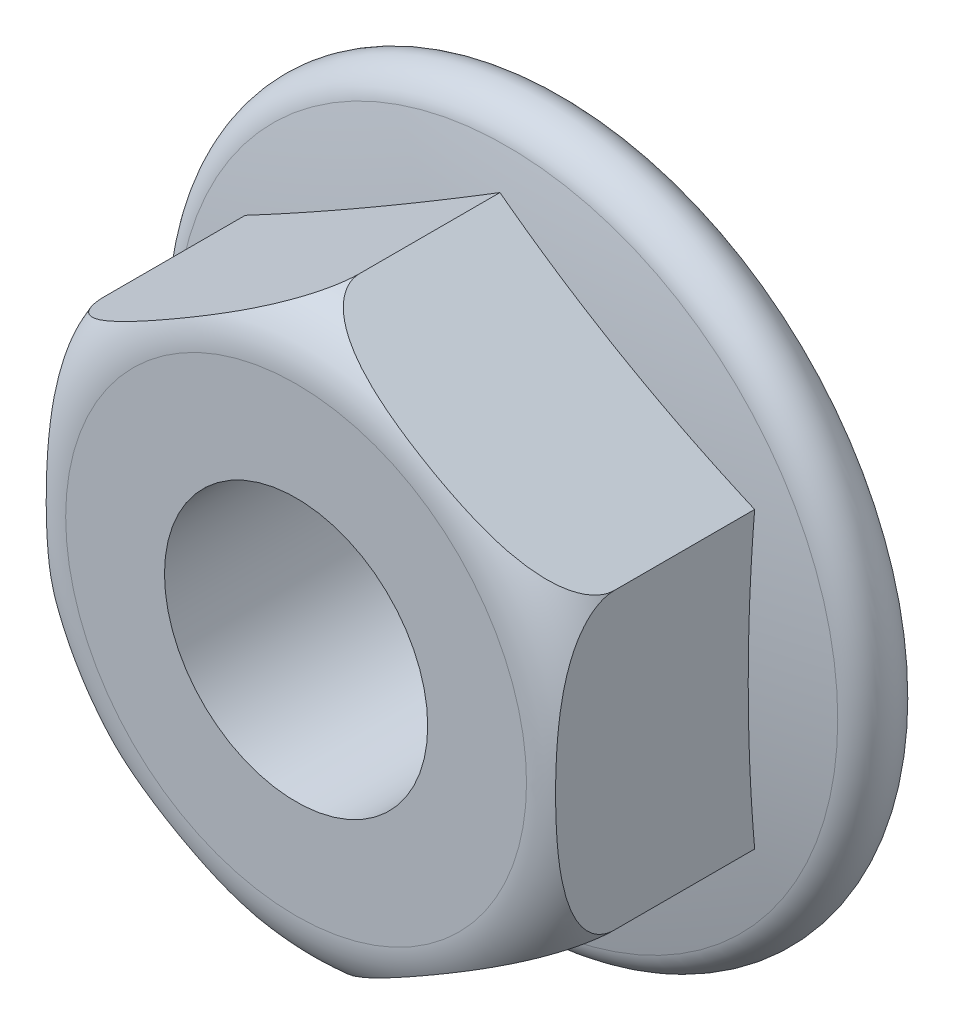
ISO-10303-21;
HEADER;
FILE_DESCRIPTION(('STEP AP214'),'2;1');
FILE_NAME('part.step','',(''),(''),'','','');
FILE_SCHEMA(('AUTOMOTIVE_DESIGN { 1 0 10303 214 1 1 1 1 }'));
ENDSEC;
DATA;
#1=APPLICATION_CONTEXT('core data for automotive mechanical design processes');
#2=APPLICATION_PROTOCOL_DEFINITION('international standard','automotive_design',2000,#1);
#3=PRODUCT_CONTEXT('',#1,'mechanical');
#4=PRODUCT('Part','Part','',(#3));
#5=PRODUCT_RELATED_PRODUCT_CATEGORY('part','',(#4));
#6=PRODUCT_DEFINITION_FORMATION('','',#4);
#7=PRODUCT_DEFINITION_CONTEXT('part definition',#1,'design');
#8=PRODUCT_DEFINITION('design','',#6,#7);
#9=PRODUCT_DEFINITION_SHAPE('','',#8);
#10=(LENGTH_UNIT() NAMED_UNIT(*) SI_UNIT(.MILLI.,.METRE.));
#11=(NAMED_UNIT(*) PLANE_ANGLE_UNIT() SI_UNIT($,.RADIAN.));
#12=(NAMED_UNIT(*) SI_UNIT($,.STERADIAN.) SOLID_ANGLE_UNIT());
#13=UNCERTAINTY_MEASURE_WITH_UNIT(LENGTH_MEASURE(1.E-05),#10,'distance_accuracy_value','');
#14=(GEOMETRIC_REPRESENTATION_CONTEXT(3) GLOBAL_UNCERTAINTY_ASSIGNED_CONTEXT((#13)) GLOBAL_UNIT_ASSIGNED_CONTEXT((#10,
#11,#12)) REPRESENTATION_CONTEXT('',''));
#15=CARTESIAN_POINT('',(0.,0.,0.));
#16=DIRECTION('',(0.,0.,1.));
#17=DIRECTION('',(1.,0.,0.));
#18=AXIS2_PLACEMENT_3D('',#15,#16,#17);
#19=CARTESIAN_POINT('',(-3.99999999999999,2.3094010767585,4.3));
#20=DIRECTION('',(-0.5,0.866025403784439,0.));
#21=DIRECTION('',(-0.866025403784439,-0.5,0.));
#22=AXIS2_PLACEMENT_3D('',#19,#20,#21);
#23=PLANE('',#22);
#24=DIRECTION('',(0.,0.,-1.));
#25=VECTOR('',#24,1.);
#26=CARTESIAN_POINT('',(-3.99999999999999,2.3094010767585,4.3));
#27=LINE('',#26,#25);
#28=CARTESIAN_POINT('',(-3.99999999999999,2.3094010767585,3.3));
#29=VERTEX_POINT('',#28);
#30=CARTESIAN_POINT('',(-3.99999999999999,2.3094010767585,1.09838133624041));
#31=VERTEX_POINT('',#30);
#32=EDGE_CURVE('E46',#29,#31,#27,.T.);
#33=ORIENTED_EDGE('',*,*,#32,.F.);
#34=CARTESIAN_POINT('',(-3.99999996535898,2.3094010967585,3.2998));
#35=CARTESIAN_POINT('',(-4.00006693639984,2.30936243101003,3.32953837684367));
#36=CARTESIAN_POINT('',(-3.99772655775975,2.31071364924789,3.35921042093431));
#37=CARTESIAN_POINT('',(-3.98871911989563,2.31591409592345,3.41742994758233));
#38=CARTESIAN_POINT('',(-3.98208701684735,2.31974314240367,3.44598455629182));
#39=CARTESIAN_POINT('',(-3.96499187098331,2.32961302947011,3.50141061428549));
#40=CARTESIAN_POINT('',(-3.95453843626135,2.33564832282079,3.52828608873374));
#41=CARTESIAN_POINT('',(-3.93043339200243,2.3495653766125,3.58008941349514));
#42=CARTESIAN_POINT('',(-3.91677501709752,2.35745104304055,3.60501299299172));
#43=CARTESIAN_POINT('',(-3.87798147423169,2.37984850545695,3.66692169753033));
#44=CARTESIAN_POINT('',(-3.85085718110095,2.39550872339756,3.70224456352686));
#45=CARTESIAN_POINT('',(-3.7921773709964,2.42938752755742,3.76755530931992));
#46=CARTESIAN_POINT('',(-3.76061113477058,2.4476123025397,3.79752987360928));
#47=CARTESIAN_POINT('',(-3.67234050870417,2.49857537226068,3.87126336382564));
#48=CARTESIAN_POINT('',(-3.61299025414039,2.53284125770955,3.91076135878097));
#49=CARTESIAN_POINT('',(-3.49007027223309,2.60380914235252,3.97948013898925));
#50=CARTESIAN_POINT('',(-3.42649081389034,2.64051675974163,4.00867617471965));
#51=CARTESIAN_POINT('',(-3.27192645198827,2.72975453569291,4.06911046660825));
#52=CARTESIAN_POINT('',(-3.17990156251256,2.78288513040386,4.09672533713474));
#53=CARTESIAN_POINT('',(-2.99393197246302,2.89025472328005,4.14172138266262));
#54=CARTESIAN_POINT('',(-2.89998324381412,2.94449604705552,4.15907818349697));
#55=CARTESIAN_POINT('',(-2.71080977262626,3.05371540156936,4.18673692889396));
#56=CARTESIAN_POINT('',(-2.61558082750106,3.10869585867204,4.19699871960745));
#57=CARTESIAN_POINT('',(-2.42493080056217,3.21876770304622,4.2123936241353));
#58=CARTESIAN_POINT('',(-2.32950999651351,3.27385892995,4.21753172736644));
#59=CARTESIAN_POINT('',(-2.1445379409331,3.38065259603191,4.22363284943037));
#60=CARTESIAN_POINT('',(-2.0549922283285,3.43235183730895,4.22483653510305));
#61=CARTESIAN_POINT('',(-1.87588150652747,3.53576146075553,4.22398619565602));
#62=CARTESIAN_POINT('',(-1.78631650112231,3.58747184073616,4.2219310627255));
#63=CARTESIAN_POINT('',(-1.60765259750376,3.6906234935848,4.21416278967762));
#64=CARTESIAN_POINT('',(-1.51855326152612,3.74206501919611,4.20846422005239));
#65=CARTESIAN_POINT('',(-1.34070462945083,3.84474597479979,4.19234278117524));
#66=CARTESIAN_POINT('',(-1.25195519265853,3.89598548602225,4.18192206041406));
#67=CARTESIAN_POINT('',(-1.07317682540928,3.99920322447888,4.15424222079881));
#68=CARTESIAN_POINT('',(-0.98316343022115,4.05117248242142,4.13683594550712));
#69=CARTESIAN_POINT('',(-0.849463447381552,4.12836420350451,4.10338551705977));
#70=CARTESIAN_POINT('',(-0.805093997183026,4.15398091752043,4.09100349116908));
#71=CARTESIAN_POINT('',(-0.717059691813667,4.20480754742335,4.06328291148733));
#72=CARTESIAN_POINT('',(-0.673394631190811,4.23001758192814,4.047945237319));
#73=CARTESIAN_POINT('',(-0.568770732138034,4.29042221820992,4.00646579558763));
#74=CARTESIAN_POINT('',(-0.508337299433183,4.32531347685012,3.97850133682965));
#75=CARTESIAN_POINT('',(-0.391336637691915,4.39286384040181,3.91326671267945));
#76=CARTESIAN_POINT('',(-0.334759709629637,4.42552854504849,3.87602107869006));
#77=CARTESIAN_POINT('',(-0.250976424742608,4.47390084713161,3.80773747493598));
#78=CARTESIAN_POINT('',(-0.221387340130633,4.4909841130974,3.78062466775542));
#79=CARTESIAN_POINT('',(-0.165742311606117,4.5231107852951,3.72186611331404));
#80=CARTESIAN_POINT('',(-0.139683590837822,4.53815579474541,3.69022396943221));
#81=CARTESIAN_POINT('',(-0.0975119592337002,4.56250359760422,3.62919400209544));
#82=CARTESIAN_POINT('',(-0.0804559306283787,4.5723509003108,3.60068306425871));
#83=CARTESIAN_POINT('',(-0.0505893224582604,4.5895943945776,3.54089256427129));
#84=CARTESIAN_POINT('',(-0.0377656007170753,4.59699817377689,3.50962196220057));
#85=CARTESIAN_POINT('',(-0.0186652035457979,4.60802579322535,3.44898520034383));
#86=CARTESIAN_POINT('',(-0.0117616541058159,4.61201155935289,3.41988566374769));
#87=CARTESIAN_POINT('',(-0.00237377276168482,4.61743165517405,3.36048910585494));
#88=CARTESIAN_POINT('',(6.98382047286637E-05,4.6188424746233,3.3301836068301));
#89=CARTESIAN_POINT('',(-3.46410181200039E-08,4.618802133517,3.2998));
#90=B_SPLINE_CURVE_WITH_KNOTS('',3,(#34,#35,#36,#37,#38,#39,#40,#41,#42,#43,#44,#45,#46,#47,#48,
#49,#50,#51,#52,#53,#54,#55,#56,#57,#58,#59,#60,#61,#62,#63,#64,#65,#66,#67,#68,#69,#70,#71,#72,
#73,#74,#75,#76,#77,#78,#79,#80,#81,#82,#83,#84,#85,#86,#87,#88,#89),.UNSPECIFIED.,.F.,.F.,(4,2,
2,2,2,2,2,2,2,2,2,2,2,2,2,2,2,2,2,2,2,2,2,2,2,2,2,4),(0.,0.0889843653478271,0.177252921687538,
0.265301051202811,0.353536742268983,0.494349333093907,0.635507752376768,0.871460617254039,
1.10797653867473,1.43649527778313,1.76579150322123,2.09693643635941,2.42775858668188,
2.73792356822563,3.04819401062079,3.35723134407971,3.66612821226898,3.98190583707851,
4.13995968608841,4.29796656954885,4.52303266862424,4.74751008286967,4.87804562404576,
5.00847788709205,5.11205914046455,5.21531565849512,5.30538832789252,5.39627935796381),.UNSPECIFIED.);
#91=CARTESIAN_POINT('',(0.,4.618802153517,3.3));
#92=VERTEX_POINT('',#91);
#93=EDGE_CURVE('E93',#29,#92,#90,.T.);
#94=ORIENTED_EDGE('',*,*,#93,.T.);
#95=DIRECTION('',(0.,0.,-1.));
#96=VECTOR('',#95,1.);
#97=CARTESIAN_POINT('',(0.,4.618802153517,4.3));
#98=LINE('',#97,#96);
#99=CARTESIAN_POINT('',(0.,4.618802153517,1.09838133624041));
#100=VERTEX_POINT('',#99);
#101=EDGE_CURVE('E100',#92,#100,#98,.T.);
#102=ORIENTED_EDGE('',*,*,#101,.T.);
#103=CARTESIAN_POINT('',(-2.,3.46410161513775,-25.26));
#104=DIRECTION('',(-0.5,0.866025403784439,0.));
#105=DIRECTION('',(-0.866025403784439,-0.5,0.));
#106=AXIS2_PLACEMENT_3D('',#103,#104,#105);
#107=CIRCLE('',#106,26.4593575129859);
#108=EDGE_CURVE('E108',#31,#100,#107,.T.);
#109=ORIENTED_EDGE('',*,*,#108,.F.);
#110=EDGE_LOOP('',(#33,#94,#102,#109));
#111=FACE_BOUND('',#110,.T.);
#112=ADVANCED_FACE('F38',(#111),#23,.T.);
#113=CARTESIAN_POINT('',(-4.00000000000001,-2.30940107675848,4.3));
#114=DIRECTION('',(-1.,0.,0.));
#115=DIRECTION('',(0.,-1.,0.));
#116=AXIS2_PLACEMENT_3D('',#113,#114,#115);
#117=PLANE('',#116);
#118=DIRECTION('',(0.,0.,-1.));
#119=VECTOR('',#118,1.);
#120=CARTESIAN_POINT('',(-4.00000000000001,-2.30940107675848,4.3));
#121=LINE('',#120,#119);
#122=CARTESIAN_POINT('',(-4.00000000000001,-2.30940107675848,3.3));
#123=VERTEX_POINT('',#122);
#124=CARTESIAN_POINT('',(-4.,-2.30940107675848,1.09838133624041));
#125=VERTEX_POINT('',#124);
#126=EDGE_CURVE('E117',#123,#125,#121,.T.);
#127=ORIENTED_EDGE('',*,*,#126,.F.);
#128=CARTESIAN_POINT('',(-4.,0.,4.22449348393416));
#129=CARTESIAN_POINT('',(-4.,0.0938029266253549,4.22449354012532));
#130=CARTESIAN_POINT('',(-4.,0.18760595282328,4.22315155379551));
#131=CARTESIAN_POINT('',(-4.,0.375150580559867,4.21755982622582));
#132=CARTESIAN_POINT('',(-4.,0.468892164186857,4.2133094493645));
#133=CARTESIAN_POINT('',(-4.,0.65602175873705,4.20123019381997));
#134=CARTESIAN_POINT('',(-4.,0.749410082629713,4.19340640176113));
#135=CARTESIAN_POINT('',(-4.,0.935650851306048,4.1730248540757));
#136=CARTESIAN_POINT('',(-4.,1.02850353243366,4.16046937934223));
#137=CARTESIAN_POINT('',(-4.,1.21307543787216,4.12891499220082));
#138=CARTESIAN_POINT('',(-4.,1.30479545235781,4.10992086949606));
#139=CARTESIAN_POINT('',(-4.,1.48610336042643,4.06303126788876));
#140=CARTESIAN_POINT('',(-4.,1.57569077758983,4.03513381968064));
#141=CARTESIAN_POINT('',(-4.,1.72830231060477,3.97553924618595));
#142=CARTESIAN_POINT('',(-4.,1.79236193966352,3.94654156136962));
#143=CARTESIAN_POINT('',(-4.,1.91572209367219,3.87969101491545));
#144=CARTESIAN_POINT('',(-4.,1.97503500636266,3.84186228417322));
#145=CARTESIAN_POINT('',(-4.,2.06220485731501,3.77325670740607));
#146=CARTESIAN_POINT('',(-3.99999999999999,2.09288594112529,3.74608878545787));
#147=CARTESIAN_POINT('',(-3.99999999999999,2.15008745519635,3.68764144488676));
#148=CARTESIAN_POINT('',(-3.99999999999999,2.17661267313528,3.65636683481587));
#149=CARTESIAN_POINT('',(-3.99999999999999,2.21934787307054,3.59601861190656));
#150=CARTESIAN_POINT('',(-3.99999999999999,2.23656032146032,3.5676616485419));
#151=CARTESIAN_POINT('',(-3.99999999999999,2.26612373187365,3.50849566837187));
#152=CARTESIAN_POINT('',(-3.99999999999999,2.27847829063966,3.47768848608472));
#153=CARTESIAN_POINT('',(-3.99999999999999,2.29740225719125,3.41400667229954));
#154=CARTESIAN_POINT('',(-3.99999999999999,2.30391865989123,3.38111594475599));
#155=CARTESIAN_POINT('',(-3.99999999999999,2.31028900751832,3.31469779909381));
#156=CARTESIAN_POINT('',(-3.99999999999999,2.31014754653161,3.28117083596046));
#157=CARTESIAN_POINT('',(-3.99999999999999,2.30372938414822,3.21952425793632));
#158=CARTESIAN_POINT('',(-3.99999999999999,2.29832118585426,3.19130916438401));
#159=CARTESIAN_POINT('',(-3.99999999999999,2.28304658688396,3.13612423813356));
#160=CARTESIAN_POINT('',(-3.99999999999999,2.27317884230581,3.10915478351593));
#161=CARTESIAN_POINT('',(-3.99999999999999,2.24600058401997,3.04897084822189));
#162=CARTESIAN_POINT('',(-3.99999999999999,2.22733669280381,3.01636972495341));
#163=CARTESIAN_POINT('',(-3.99999999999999,2.18498581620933,2.9546162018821));
#164=CARTESIAN_POINT('',(-3.99999999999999,2.16128864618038,2.92547098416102));
#165=CARTESIAN_POINT('',(-3.99999999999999,2.09764904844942,2.85718234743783));
#166=CARTESIAN_POINT('',(-4.,2.05544525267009,2.82016177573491));
#167=CARTESIAN_POINT('',(-4.,1.96596513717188,2.75297844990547));
#168=CARTESIAN_POINT('',(-4.,1.91867988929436,2.7228280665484));
#169=CARTESIAN_POINT('',(-4.,1.82542710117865,2.67078581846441));
#170=CARTESIAN_POINT('',(-4.,1.77973451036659,2.64839086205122));
#171=CARTESIAN_POINT('',(-4.,1.68658396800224,2.60757873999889));
#172=CARTESIAN_POINT('',(-4.,1.63912445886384,2.58916518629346));
#173=CARTESIAN_POINT('',(-4.,1.54291831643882,2.55563775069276));
#174=CARTESIAN_POINT('',(-4.,1.49416837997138,2.5405334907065));
#175=CARTESIAN_POINT('',(-4.,1.39591987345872,2.51315258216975));
#176=CARTESIAN_POINT('',(-4.,1.34642169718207,2.50087449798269));
#177=CARTESIAN_POINT('',(-4.,1.21347450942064,2.47121229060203));
#178=CARTESIAN_POINT('',(-4.,1.12955678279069,2.45593927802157));
#179=CARTESIAN_POINT('',(-4.,0.960958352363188,2.43029743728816));
#180=CARTESIAN_POINT('',(-4.,0.876277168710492,2.41993194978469));
#181=CARTESIAN_POINT('',(-4.,0.706315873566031,2.40290165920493));
#182=CARTESIAN_POINT('',(-4.,0.621034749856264,2.3962472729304));
#183=CARTESIAN_POINT('',(-4.,0.45032547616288,2.38585497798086));
#184=CARTESIAN_POINT('',(-4.,0.3648973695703,2.38211632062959));
#185=CARTESIAN_POINT('',(-4.,0.193190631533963,2.37703368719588));
#186=CARTESIAN_POINT('',(-4.,0.106911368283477,2.37571192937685));
#187=CARTESIAN_POINT('',(-4.,-0.0656610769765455,2.37534495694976));
#188=CARTESIAN_POINT('',(-4.,-0.151954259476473,2.37629999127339));
#189=CARTESIAN_POINT('',(-4.,-0.324305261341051,2.38061694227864));
#190=CARTESIAN_POINT('',(-4.,-0.410363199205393,2.38397389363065));
#191=CARTESIAN_POINT('',(-4.,-0.582311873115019,2.39354456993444));
#192=CARTESIAN_POINT('',(-4.,-0.66820263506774,2.399757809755));
#193=CARTESIAN_POINT('',(-4.,-0.846082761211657,2.41643295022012));
#194=CARTESIAN_POINT('',(-4.,-0.938046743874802,2.42717837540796));
#195=CARTESIAN_POINT('',(-4.,-1.1213152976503,2.45437717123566));
#196=CARTESIAN_POINT('',(-4.,-1.21261864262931,2.47083926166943));
#197=CARTESIAN_POINT('',(-4.,-1.39223847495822,2.51128945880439));
#198=CARTESIAN_POINT('',(-4.,-1.48057894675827,2.5351677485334));
#199=CARTESIAN_POINT('',(-4.,-1.65369370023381,2.59329463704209));
#200=CARTESIAN_POINT('',(-4.,-1.73847920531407,2.62750727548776));
#201=CARTESIAN_POINT('',(-4.,-1.86769365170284,2.69328032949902));
#202=CARTESIAN_POINT('',(-4.,-1.91445548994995,2.72021117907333));
#203=CARTESIAN_POINT('',(-4.,-2.00409079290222,2.78010625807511));
#204=CARTESIAN_POINT('',(-4.,-2.04696380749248,2.81307118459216));
#205=CARTESIAN_POINT('',(-4.,-2.11593661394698,2.87629384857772));
#206=CARTESIAN_POINT('',(-4.00000000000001,-2.14347586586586,2.90496727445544));
#207=CARTESIAN_POINT('',(-4.00000000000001,-2.19377764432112,2.96625261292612));
#208=CARTESIAN_POINT('',(-4.00000000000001,-2.21654845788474,2.99885753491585));
#209=CARTESIAN_POINT('',(-4.00000000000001,-2.2513279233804,3.06018740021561));
#210=CARTESIAN_POINT('',(-4.00000000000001,-2.26460200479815,3.08818980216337));
#211=CARTESIAN_POINT('',(-4.00000000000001,-2.28635138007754,3.14601091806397));
#212=CARTESIAN_POINT('',(-4.00000000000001,-2.29483047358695,3.17582817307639));
#213=CARTESIAN_POINT('',(-4.00000000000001,-2.30633410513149,3.2366963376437));
#214=CARTESIAN_POINT('',(-4.00000000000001,-2.30932668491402,3.26775340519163));
#215=CARTESIAN_POINT('',(-4.00000000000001,-2.30947267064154,3.32988100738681));
#216=CARTESIAN_POINT('',(-4.00000000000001,-2.3066266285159,3.36095154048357));
#217=CARTESIAN_POINT('',(-4.00000000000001,-2.29587021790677,3.41934843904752));
#218=CARTESIAN_POINT('',(-4.00000000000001,-2.28842788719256,3.44676357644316));
#219=CARTESIAN_POINT('',(-4.00000000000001,-2.26944739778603,3.50012278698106));
#220=CARTESIAN_POINT('',(-4.00000000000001,-2.25790777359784,3.52606632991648));
#221=CARTESIAN_POINT('',(-4.00000000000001,-2.2259792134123,3.58629797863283));
#222=CARTESIAN_POINT('',(-4.00000000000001,-2.20389996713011,3.6196887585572));
#223=CARTESIAN_POINT('',(-4.00000000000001,-2.1546858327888,3.68250188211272));
#224=CARTESIAN_POINT('',(-4.,-2.12753978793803,3.71191521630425));
#225=CARTESIAN_POINT('',(-4.,-2.05390946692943,3.78185123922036));
#226=CARTESIAN_POINT('',(-4.,-2.00493121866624,3.81972826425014));
#227=CARTESIAN_POINT('',(-4.,-1.90191391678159,3.88772449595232));
#228=CARTESIAN_POINT('',(-4.,-1.84786362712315,3.91782589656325));
#229=CARTESIAN_POINT('',(-4.,-1.73942977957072,3.97038611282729));
#230=CARTESIAN_POINT('',(-4.,-1.68518779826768,3.99314331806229));
#231=CARTESIAN_POINT('',(-4.,-1.57494963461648,4.03399036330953));
#232=CARTESIAN_POINT('',(-4.,-1.51895178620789,4.05207561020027));
#233=CARTESIAN_POINT('',(-4.,-1.40577740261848,4.08445621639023));
#234=CARTESIAN_POINT('',(-4.,-1.34859885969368,4.09874442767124));
#235=CARTESIAN_POINT('',(-4.,-1.23354374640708,4.12419445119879));
#236=CARTESIAN_POINT('',(-4.,-1.17566694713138,4.13535520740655));
#237=CARTESIAN_POINT('',(-4.,-1.02545055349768,4.16091672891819));
#238=CARTESIAN_POINT('',(-4.,-0.932785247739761,4.1733851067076));
#239=CARTESIAN_POINT('',(-4.,-0.746936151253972,4.19362918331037));
#240=CARTESIAN_POINT('',(-4.,-0.653752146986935,4.20140277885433));
#241=CARTESIAN_POINT('',(-4.,-0.467170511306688,4.21339392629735));
#242=CARTESIAN_POINT('',(-4.,-0.373772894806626,4.21761171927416));
#243=CARTESIAN_POINT('',(-4.,-0.186916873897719,4.22316116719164));
#244=CARTESIAN_POINT('',(-4.,-0.0934584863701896,4.22449342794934));
#245=CARTESIAN_POINT('',(-4.,0.,4.22449348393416));
#246=B_SPLINE_CURVE_WITH_KNOTS('',3,(#128,#129,#130,#131,#132,#133,#134,#135,#136,#137,#138,
#139,#140,#141,#142,#143,#144,#145,#146,#147,#148,#149,#150,#151,#152,#153,#154,#155,#156,#157,
#158,#159,#160,#161,#162,#163,#164,#165,#166,#167,#168,#169,#170,#171,#172,#173,#174,#175,#176,
#177,#178,#179,#180,#181,#182,#183,#184,#185,#186,#187,#188,#189,#190,#191,#192,#193,#194,#195,
#196,#197,#198,#199,#200,#201,#202,#203,#204,#205,#206,#207,#208,#209,#210,#211,#212,#213,#214,
#215,#216,#217,#218,#219,#220,#221,#222,#223,#224,#225,#226,#227,#228,#229,#230,#231,#232,#233,
#234,#235,#236,#237,#238,#239,#240,#241,#242,#243,#244,#245),.UNSPECIFIED.,.T.,.F.,(4,2,2,2,2,2,
2,2,2,2,2,2,2,2,2,2,2,2,2,2,2,2,2,2,2,2,2,2,2,2,2,2,2,2,2,2,2,2,2,2,2,2,2,2,2,2,2,2,2,2,2,2,2,2,
2,2,2,2,4),(0.,0.281398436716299,0.562858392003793,0.843918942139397,1.12484418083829,
1.40556089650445,1.68633974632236,1.89683010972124,2.10675190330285,2.2293804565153,
2.3518666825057,2.45100698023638,2.55007373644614,2.65003107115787,2.74991943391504,
2.83571347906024,2.92153339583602,3.03360603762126,3.14590765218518,3.3133831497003,
3.48115786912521,3.63358953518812,3.78615891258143,3.93916617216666,4.09209553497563,
4.347763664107,4.60360558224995,4.86016206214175,5.1166526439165,5.37548948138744,
5.63435461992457,5.89268616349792,6.15097384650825,6.42861943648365,6.70669040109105,
6.9808256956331,7.25401786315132,7.41556936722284,7.57713954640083,7.69603886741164,
7.81472980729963,7.90733077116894,7.99985825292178,8.09292300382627,8.18597895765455,
8.27084034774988,8.35573212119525,8.47514851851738,8.59483103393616,8.77953303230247,
8.96465431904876,9.14085472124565,9.31722769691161,9.49393038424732,9.6706926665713,
9.95101022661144,10.2314532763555,10.511877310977,10.7922424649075),.UNSPECIFIED.);
#247=EDGE_CURVE('E103',#123,#29,#246,.T.);
#248=ORIENTED_EDGE('',*,*,#247,.T.);
#249=ORIENTED_EDGE('',*,*,#32,.T.);
#250=CARTESIAN_POINT('',(-4.,0.,-25.26));
#251=DIRECTION('',(-1.,0.,0.));
#252=DIRECTION('',(0.,-1.,0.));
#253=AXIS2_PLACEMENT_3D('',#250,#251,#252);
#254=CIRCLE('',#253,26.4593575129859);
#255=EDGE_CURVE('E111',#125,#31,#254,.T.);
#256=ORIENTED_EDGE('',*,*,#255,.F.);
#257=EDGE_LOOP('',(#127,#248,#249,#256));
#258=FACE_BOUND('',#257,.T.);
#259=ADVANCED_FACE('F188',(#258),#117,.T.);
#260=CARTESIAN_POINT('',(0.,-4.618802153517,4.3));
#261=DIRECTION('',(-0.500000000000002,-0.866025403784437,0.));
#262=DIRECTION('',(0.866025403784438,-0.500000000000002,0.));
#263=AXIS2_PLACEMENT_3D('',#260,#261,#262);
#264=PLANE('',#263);
#265=DIRECTION('',(0.,0.,-1.));
#266=VECTOR('',#265,1.);
#267=CARTESIAN_POINT('',(0.,-4.618802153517,4.3));
#268=LINE('',#267,#266);
#269=CARTESIAN_POINT('',(0.,-4.618802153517,3.3));
#270=VERTEX_POINT('',#269);
#271=CARTESIAN_POINT('',(0.,-4.618802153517,1.09838133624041));
#272=VERTEX_POINT('',#271);
#273=EDGE_CURVE('E115',#270,#272,#268,.T.);
#274=ORIENTED_EDGE('',*,*,#273,.F.);
#275=CARTESIAN_POINT('',(-3.46410169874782E-08,-4.618802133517,3.2998));
#276=CARTESIAN_POINT('',(6.69363998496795E-05,-4.61884079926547,3.32953837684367));
#277=CARTESIAN_POINT('',(-0.0022734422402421,-4.61748958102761,3.35921042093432));
#278=CARTESIAN_POINT('',(-0.0112808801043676,-4.61228913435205,3.41742994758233));
#279=CARTESIAN_POINT('',(-0.017912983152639,-4.60846008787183,3.44598455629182));
#280=CARTESIAN_POINT('',(-0.0350081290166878,-4.59859020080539,3.50141061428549));
#281=CARTESIAN_POINT('',(-0.0454615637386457,-4.59255490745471,3.52828608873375));
#282=CARTESIAN_POINT('',(-0.0695666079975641,-4.578637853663,3.58008941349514));
#283=CARTESIAN_POINT('',(-0.0832249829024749,-4.57075218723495,3.60501299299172));
#284=CARTESIAN_POINT('',(-0.122018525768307,-4.54835472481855,3.66692169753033));
#285=CARTESIAN_POINT('',(-0.149142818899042,-4.53269450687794,3.70224456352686));
#286=CARTESIAN_POINT('',(-0.20782262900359,-4.49881570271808,3.76755530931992));
#287=CARTESIAN_POINT('',(-0.239388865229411,-4.4805909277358,3.79752987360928));
#288=CARTESIAN_POINT('',(-0.32765949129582,-4.42962785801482,3.87126336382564));
#289=CARTESIAN_POINT('',(-0.387009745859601,-4.39536197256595,3.91076135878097));
#290=CARTESIAN_POINT('',(-0.509929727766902,-4.32439408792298,3.97948013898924));
#291=CARTESIAN_POINT('',(-0.57350918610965,-4.28768647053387,4.00867617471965));
#292=CARTESIAN_POINT('',(-0.728073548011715,-4.19844869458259,4.06911046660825));
#293=CARTESIAN_POINT('',(-0.820098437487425,-4.14531809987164,4.09672533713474));
#294=CARTESIAN_POINT('',(-1.00606802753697,-4.03794850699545,4.14172138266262));
#295=CARTESIAN_POINT('',(-1.10001675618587,-3.98370718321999,4.15907818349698));
#296=CARTESIAN_POINT('',(-1.28919022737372,-3.87448782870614,4.18673692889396));
#297=CARTESIAN_POINT('',(-1.38441917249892,-3.81950737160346,4.19699871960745));
#298=CARTESIAN_POINT('',(-1.57506919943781,-3.70943552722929,4.2123936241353));
#299=CARTESIAN_POINT('',(-1.67049000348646,-3.6543443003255,4.21753172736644));
#300=CARTESIAN_POINT('',(-1.85546205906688,-3.5475506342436,4.22363284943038));
#301=CARTESIAN_POINT('',(-1.94500777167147,-3.49585139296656,4.22483653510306));
#302=CARTESIAN_POINT('',(-2.12411849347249,-3.39244176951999,4.22398619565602));
#303=CARTESIAN_POINT('',(-2.21368349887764,-3.34073138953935,4.22193106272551));
#304=CARTESIAN_POINT('',(-2.39234740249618,-3.23757973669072,4.21416278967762));
#305=CARTESIAN_POINT('',(-2.48144673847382,-3.18613821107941,4.20846422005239));
#306=CARTESIAN_POINT('',(-2.6592953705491,-3.08345725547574,4.19234278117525));
#307=CARTESIAN_POINT('',(-2.74804480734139,-3.03221774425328,4.18192206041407));
#308=CARTESIAN_POINT('',(-2.92682317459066,-2.92900000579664,4.15424222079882));
#309=CARTESIAN_POINT('',(-3.01683656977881,-2.87703074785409,4.13683594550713));
#310=CARTESIAN_POINT('',(-3.15053655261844,-2.79983902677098,4.10338551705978));
#311=CARTESIAN_POINT('',(-3.19490600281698,-2.77422231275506,4.09100349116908));
#312=CARTESIAN_POINT('',(-3.28294030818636,-2.72339568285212,4.06328291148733));
#313=CARTESIAN_POINT('',(-3.32660536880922,-2.69818564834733,4.047945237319));
#314=CARTESIAN_POINT('',(-3.43122926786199,-2.63778101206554,4.00646579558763));
#315=CARTESIAN_POINT('',(-3.49166270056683,-2.60288975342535,3.97850133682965));
#316=CARTESIAN_POINT('',(-3.60866336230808,-2.53533938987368,3.91326671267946));
#317=CARTESIAN_POINT('',(-3.66524029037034,-2.50267468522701,3.87602107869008));
#318=CARTESIAN_POINT('',(-3.74902357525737,-2.45430238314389,3.80773747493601));
#319=CARTESIAN_POINT('',(-3.77861265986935,-2.43721911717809,3.78062466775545));
#320=CARTESIAN_POINT('',(-3.83425768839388,-2.40509244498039,3.72186611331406));
#321=CARTESIAN_POINT('',(-3.86031640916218,-2.39004743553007,3.69022396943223));
#322=CARTESIAN_POINT('',(-3.9024880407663,-2.36569963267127,3.62919400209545));
#323=CARTESIAN_POINT('',(-3.91954406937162,-2.35585232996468,3.60068306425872));
#324=CARTESIAN_POINT('',(-3.94941067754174,-2.33860883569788,3.5408925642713));
#325=CARTESIAN_POINT('',(-3.96223439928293,-2.33120505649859,3.50962196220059));
#326=CARTESIAN_POINT('',(-3.98133479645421,-2.32017743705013,3.44898520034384));
#327=CARTESIAN_POINT('',(-3.98823834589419,-2.31619167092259,3.4198856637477));
#328=CARTESIAN_POINT('',(-3.99762622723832,-2.31077157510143,3.36048910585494));
#329=CARTESIAN_POINT('',(-4.00006983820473,-2.30936075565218,3.3301836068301));
#330=CARTESIAN_POINT('',(-3.99999996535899,-2.30940109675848,3.2998));
#331=B_SPLINE_CURVE_WITH_KNOTS('',3,(#275,#276,#277,#278,#279,#280,#281,#282,#283,#284,#285,
#286,#287,#288,#289,#290,#291,#292,#293,#294,#295,#296,#297,#298,#299,#300,#301,#302,#303,#304,
#305,#306,#307,#308,#309,#310,#311,#312,#313,#314,#315,#316,#317,#318,#319,#320,#321,#322,#323,
#324,#325,#326,#327,#328,#329,#330),.UNSPECIFIED.,.F.,.F.,(4,2,2,2,2,2,2,2,2,2,2,2,2,2,2,2,2,2,
2,2,2,2,2,2,2,2,2,4),(0.,0.0889843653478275,0.177252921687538,0.265301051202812,
0.353536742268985,0.494349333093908,0.635507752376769,0.871460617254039,1.10797653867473,
1.43649527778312,1.76579150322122,2.0969364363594,2.42775858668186,2.73792356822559,
3.04819401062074,3.35723134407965,3.6661282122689,3.9819058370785,4.13995968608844,
4.29796656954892,4.52303266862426,4.74751008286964,4.87804562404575,5.00847788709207,
5.11205914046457,5.21531565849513,5.30538832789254,5.39627935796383),.UNSPECIFIED.);
#332=EDGE_CURVE('E177',#270,#123,#331,.T.);
#333=ORIENTED_EDGE('',*,*,#332,.T.);
#334=ORIENTED_EDGE('',*,*,#126,.T.);
#335=CARTESIAN_POINT('',(-2.,-3.46410161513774,-25.26));
#336=DIRECTION('',(-0.500000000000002,-0.866025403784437,0.));
#337=DIRECTION('',(0.866025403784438,-0.500000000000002,0.));
#338=AXIS2_PLACEMENT_3D('',#335,#336,#337);
#339=CIRCLE('',#338,26.4593575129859);
#340=EDGE_CURVE('E122',#272,#125,#339,.T.);
#341=ORIENTED_EDGE('',*,*,#340,.F.);
#342=EDGE_LOOP('',(#274,#333,#334,#341));
#343=FACE_BOUND('',#342,.T.);
#344=ADVANCED_FACE('F184',(#343),#264,.T.);
#345=CARTESIAN_POINT('',(3.99999999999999,-2.3094010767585,4.3));
#346=DIRECTION('',(0.5,-0.866025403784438,0.));
#347=DIRECTION('',(0.866025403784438,0.5,0.));
#348=AXIS2_PLACEMENT_3D('',#345,#346,#347);
#349=PLANE('',#348);
#350=DIRECTION('',(0.,0.,-1.));
#351=VECTOR('',#350,1.);
#352=CARTESIAN_POINT('',(3.99999999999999,-2.3094010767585,4.3));
#353=LINE('',#352,#351);
#354=CARTESIAN_POINT('',(3.99999999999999,-2.3094010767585,3.3));
#355=VERTEX_POINT('',#354);
#356=CARTESIAN_POINT('',(3.99999999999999,-2.3094010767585,1.09838133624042));
#357=VERTEX_POINT('',#356);
#358=EDGE_CURVE('E109',#355,#357,#353,.T.);
#359=ORIENTED_EDGE('',*,*,#358,.F.);
#360=CARTESIAN_POINT('',(3.99999996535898,-2.3094010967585,3.2998));
#361=CARTESIAN_POINT('',(4.00006693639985,-2.30936243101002,3.32953837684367));
#362=CARTESIAN_POINT('',(3.99772655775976,-2.31071364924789,3.35921042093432));
#363=CARTESIAN_POINT('',(3.98871911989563,-2.31591409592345,3.41742994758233));
#364=CARTESIAN_POINT('',(3.98208701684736,-2.31974314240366,3.44598455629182));
#365=CARTESIAN_POINT('',(3.96499187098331,-2.32961302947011,3.50141061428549));
#366=CARTESIAN_POINT('',(3.95453843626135,-2.33564832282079,3.52828608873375));
#367=CARTESIAN_POINT('',(3.93043339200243,-2.3495653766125,3.58008941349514));
#368=CARTESIAN_POINT('',(3.91677501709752,-2.35745104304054,3.60501299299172));
#369=CARTESIAN_POINT('',(3.87798147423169,-2.37984850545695,3.66692169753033));
#370=CARTESIAN_POINT('',(3.85085718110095,-2.39550872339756,3.70224456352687));
#371=CARTESIAN_POINT('',(3.7921773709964,-2.42938752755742,3.76755530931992));
#372=CARTESIAN_POINT('',(3.76061113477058,-2.4476123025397,3.79752987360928));
#373=CARTESIAN_POINT('',(3.67234050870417,-2.49857537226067,3.87126336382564));
#374=CARTESIAN_POINT('',(3.61299025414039,-2.53284125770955,3.91076135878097));
#375=CARTESIAN_POINT('',(3.49007027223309,-2.60380914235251,3.97948013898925));
#376=CARTESIAN_POINT('',(3.42649081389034,-2.64051675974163,4.00867617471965));
#377=CARTESIAN_POINT('',(3.27192645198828,-2.72975453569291,4.06911046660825));
#378=CARTESIAN_POINT('',(3.17990156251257,-2.78288513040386,4.09672533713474));
#379=CARTESIAN_POINT('',(2.99393197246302,-2.89025472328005,4.14172138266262));
#380=CARTESIAN_POINT('',(2.89998324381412,-2.94449604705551,4.15907818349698));
#381=CARTESIAN_POINT('',(2.71080977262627,-3.05371540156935,4.18673692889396));
#382=CARTESIAN_POINT('',(2.61558082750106,-3.10869585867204,4.19699871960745));
#383=CARTESIAN_POINT('',(2.42493080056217,-3.21876770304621,4.2123936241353));
#384=CARTESIAN_POINT('',(2.32950999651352,-3.27385892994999,4.21753172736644));
#385=CARTESIAN_POINT('',(2.1445379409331,-3.38065259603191,4.22363284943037));
#386=CARTESIAN_POINT('',(2.05499222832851,-3.43235183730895,4.22483653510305));
#387=CARTESIAN_POINT('',(1.87588150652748,-3.53576146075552,4.22398619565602));
#388=CARTESIAN_POINT('',(1.78631650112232,-3.58747184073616,4.2219310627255));
#389=CARTESIAN_POINT('',(1.60765259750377,-3.69062349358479,4.21416278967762));
#390=CARTESIAN_POINT('',(1.51855326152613,-3.7420650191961,4.20846422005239));
#391=CARTESIAN_POINT('',(1.34070462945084,-3.84474597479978,4.19234278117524));
#392=CARTESIAN_POINT('',(1.25195519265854,-3.89598548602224,4.18192206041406));
#393=CARTESIAN_POINT('',(1.0731768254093,-3.99920322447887,4.15424222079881));
#394=CARTESIAN_POINT('',(0.983163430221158,-4.05117248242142,4.13683594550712));
#395=CARTESIAN_POINT('',(0.849463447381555,-4.12836420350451,4.10338551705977));
#396=CARTESIAN_POINT('',(0.805093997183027,-4.15398091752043,4.09100349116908));
#397=CARTESIAN_POINT('',(0.717059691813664,-4.20480754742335,4.06328291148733));
#398=CARTESIAN_POINT('',(0.673394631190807,-4.23001758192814,4.047945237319));
#399=CARTESIAN_POINT('',(0.568770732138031,-4.29042221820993,4.00646579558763));
#400=CARTESIAN_POINT('',(0.508337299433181,-4.32531347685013,3.97850133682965));
#401=CARTESIAN_POINT('',(0.391336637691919,-4.39286384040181,3.91326671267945));
#402=CARTESIAN_POINT('',(0.334759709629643,-4.42552854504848,3.87602107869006));
#403=CARTESIAN_POINT('',(0.250976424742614,-4.4739008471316,3.80773747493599));
#404=CARTESIAN_POINT('',(0.221387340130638,-4.4909841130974,3.78062466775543));
#405=CARTESIAN_POINT('',(0.16574231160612,-4.5231107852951,3.72186611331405));
#406=CARTESIAN_POINT('',(0.139683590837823,-4.53815579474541,3.69022396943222));
#407=CARTESIAN_POINT('',(0.0975119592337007,-4.56250359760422,3.62919400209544));
#408=CARTESIAN_POINT('',(0.0804559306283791,-4.5723509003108,3.60068306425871));
#409=CARTESIAN_POINT('',(0.0505893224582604,-4.5895943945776,3.54089256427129));
#410=CARTESIAN_POINT('',(0.0377656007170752,-4.59699817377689,3.50962196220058));
#411=CARTESIAN_POINT('',(0.0186652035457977,-4.60802579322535,3.44898520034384));
#412=CARTESIAN_POINT('',(0.011761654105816,-4.61201155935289,3.41988566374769));
#413=CARTESIAN_POINT('',(0.002373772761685,-4.61743165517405,3.36048910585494));
#414=CARTESIAN_POINT('',(-6.98382047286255E-05,-4.6188424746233,3.3301836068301));
#415=CARTESIAN_POINT('',(3.46410171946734E-08,-4.618802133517,3.2998));
#416=B_SPLINE_CURVE_WITH_KNOTS('',3,(#360,#361,#362,#363,#364,#365,#366,#367,#368,#369,#370,
#371,#372,#373,#374,#375,#376,#377,#378,#379,#380,#381,#382,#383,#384,#385,#386,#387,#388,#389,
#390,#391,#392,#393,#394,#395,#396,#397,#398,#399,#400,#401,#402,#403,#404,#405,#406,#407,#408,
#409,#410,#411,#412,#413,#414,#415),.UNSPECIFIED.,.F.,.F.,(4,2,2,2,2,2,2,2,2,2,2,2,2,2,2,2,2,2,
2,2,2,2,2,2,2,2,2,4),(0.,0.0889843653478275,0.177252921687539,0.265301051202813,
0.353536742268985,0.49434933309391,0.63550775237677,0.87146061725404,1.10797653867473,
1.43649527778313,1.76579150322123,2.09693643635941,2.42775858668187,2.73792356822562,
3.04819401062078,3.3572313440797,3.66612821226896,3.98190583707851,4.13995968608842,
4.29796656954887,4.52303266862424,4.74751008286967,4.87804562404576,5.00847788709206,
5.11205914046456,5.21531565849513,5.30538832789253,5.39627935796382),.UNSPECIFIED.);
#417=EDGE_CURVE('E171',#355,#270,#416,.T.);
#418=ORIENTED_EDGE('',*,*,#417,.T.);
#419=ORIENTED_EDGE('',*,*,#273,.T.);
#420=CARTESIAN_POINT('',(2.,-3.46410161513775,-25.26));
#421=DIRECTION('',(0.5,-0.866025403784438,0.));
#422=DIRECTION('',(0.866025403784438,0.5,0.));
#423=AXIS2_PLACEMENT_3D('',#420,#421,#422);
#424=CIRCLE('',#423,26.4593575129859);
#425=EDGE_CURVE('E125',#357,#272,#424,.T.);
#426=ORIENTED_EDGE('',*,*,#425,.F.);
#427=EDGE_LOOP('',(#359,#418,#419,#426));
#428=FACE_BOUND('',#427,.T.);
#429=ADVANCED_FACE('F187',(#428),#349,.T.);
#430=CARTESIAN_POINT('',(4.00000000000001,2.30940107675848,4.3));
#431=DIRECTION('',(1.,0.,0.));
#432=DIRECTION('',(0.,1.,0.));
#433=AXIS2_PLACEMENT_3D('',#430,#431,#432);
#434=PLANE('',#433);
#435=DIRECTION('',(0.,0.,-1.));
#436=VECTOR('',#435,1.);
#437=CARTESIAN_POINT('',(4.00000000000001,2.30940107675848,4.3));
#438=LINE('',#437,#436);
#439=CARTESIAN_POINT('',(4.00000000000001,2.30940107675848,3.3));
#440=VERTEX_POINT('',#439);
#441=CARTESIAN_POINT('',(4.,2.30940107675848,1.09838133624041));
#442=VERTEX_POINT('',#441);
#443=EDGE_CURVE('E107',#440,#442,#438,.T.);
#444=ORIENTED_EDGE('',*,*,#443,.F.);
#445=CARTESIAN_POINT('',(4.,0.,4.22449348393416));
#446=CARTESIAN_POINT('',(4.,-0.0938029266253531,4.22449354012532));
#447=CARTESIAN_POINT('',(4.,-0.187605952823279,4.22315155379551));
#448=CARTESIAN_POINT('',(4.,-0.375150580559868,4.21755982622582));
#449=CARTESIAN_POINT('',(4.,-0.468892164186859,4.21330944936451));
#450=CARTESIAN_POINT('',(4.,-0.656021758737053,4.20123019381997));
#451=CARTESIAN_POINT('',(4.,-0.749410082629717,4.19340640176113));
#452=CARTESIAN_POINT('',(4.,-0.935650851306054,4.17302485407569));
#453=CARTESIAN_POINT('',(4.,-1.02850353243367,4.16046937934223));
#454=CARTESIAN_POINT('',(4.,-1.21307543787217,4.12891499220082));
#455=CARTESIAN_POINT('',(4.,-1.30479545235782,4.10992086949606));
#456=CARTESIAN_POINT('',(4.,-1.48610336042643,4.06303126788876));
#457=CARTESIAN_POINT('',(3.99999999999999,-1.57569077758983,4.03513381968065));
#458=CARTESIAN_POINT('',(3.99999999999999,-1.72830231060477,3.97553924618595));
#459=CARTESIAN_POINT('',(3.99999999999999,-1.79236193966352,3.94654156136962));
#460=CARTESIAN_POINT('',(3.99999999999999,-1.91572209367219,3.87969101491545));
#461=CARTESIAN_POINT('',(3.99999999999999,-1.97503500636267,3.84186228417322));
#462=CARTESIAN_POINT('',(3.99999999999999,-2.06220485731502,3.77325670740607));
#463=CARTESIAN_POINT('',(3.99999999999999,-2.09288594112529,3.74608878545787));
#464=CARTESIAN_POINT('',(3.99999999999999,-2.15008745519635,3.68764144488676));
#465=CARTESIAN_POINT('',(3.99999999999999,-2.17661267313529,3.65636683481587));
#466=CARTESIAN_POINT('',(3.99999999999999,-2.21934787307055,3.59601861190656));
#467=CARTESIAN_POINT('',(3.99999999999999,-2.23656032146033,3.5676616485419));
#468=CARTESIAN_POINT('',(3.99999999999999,-2.26612373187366,3.50849566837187));
#469=CARTESIAN_POINT('',(3.99999999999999,-2.27847829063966,3.47768848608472));
#470=CARTESIAN_POINT('',(3.99999999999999,-2.29740225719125,3.41400667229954));
#471=CARTESIAN_POINT('',(3.99999999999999,-2.30391865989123,3.38111594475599));
#472=CARTESIAN_POINT('',(3.99999999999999,-2.31028900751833,3.31469779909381));
#473=CARTESIAN_POINT('',(3.99999999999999,-2.31014754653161,3.28117083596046));
#474=CARTESIAN_POINT('',(3.99999999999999,-2.30372938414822,3.21952425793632));
#475=CARTESIAN_POINT('',(3.99999999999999,-2.29832118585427,3.191309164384));
#476=CARTESIAN_POINT('',(3.99999999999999,-2.28304658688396,3.13612423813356));
#477=CARTESIAN_POINT('',(3.99999999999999,-2.27317884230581,3.10915478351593));
#478=CARTESIAN_POINT('',(3.99999999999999,-2.24600058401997,3.04897084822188));
#479=CARTESIAN_POINT('',(3.99999999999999,-2.22733669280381,3.01636972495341));
#480=CARTESIAN_POINT('',(3.99999999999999,-2.18498581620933,2.95461620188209));
#481=CARTESIAN_POINT('',(3.99999999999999,-2.16128864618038,2.92547098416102));
#482=CARTESIAN_POINT('',(3.99999999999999,-2.09764904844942,2.85718234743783));
#483=CARTESIAN_POINT('',(3.99999999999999,-2.05544525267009,2.8201617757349));
#484=CARTESIAN_POINT('',(3.99999999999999,-1.96596513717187,2.75297844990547));
#485=CARTESIAN_POINT('',(3.99999999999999,-1.91867988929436,2.7228280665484));
#486=CARTESIAN_POINT('',(3.99999999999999,-1.82542710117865,2.67078581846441));
#487=CARTESIAN_POINT('',(3.99999999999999,-1.77973451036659,2.64839086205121));
#488=CARTESIAN_POINT('',(3.99999999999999,-1.68658396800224,2.60757873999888));
#489=CARTESIAN_POINT('',(3.99999999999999,-1.63912445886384,2.58916518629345));
#490=CARTESIAN_POINT('',(3.99999999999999,-1.54291831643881,2.55563775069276));
#491=CARTESIAN_POINT('',(4.,-1.49416837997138,2.5405334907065));
#492=CARTESIAN_POINT('',(4.,-1.39591987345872,2.51315258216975));
#493=CARTESIAN_POINT('',(4.,-1.34642169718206,2.50087449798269));
#494=CARTESIAN_POINT('',(4.,-1.21347450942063,2.47121229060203));
#495=CARTESIAN_POINT('',(4.,-1.12955678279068,2.45593927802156));
#496=CARTESIAN_POINT('',(4.,-0.960958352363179,2.43029743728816));
#497=CARTESIAN_POINT('',(4.,-0.876277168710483,2.41993194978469));
#498=CARTESIAN_POINT('',(4.,-0.70631587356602,2.40290165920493));
#499=CARTESIAN_POINT('',(4.,-0.621034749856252,2.3962472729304));
#500=CARTESIAN_POINT('',(4.,-0.450325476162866,2.38585497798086));
#501=CARTESIAN_POINT('',(4.,-0.364897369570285,2.38211632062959));
#502=CARTESIAN_POINT('',(4.,-0.193190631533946,2.37703368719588));
#503=CARTESIAN_POINT('',(4.,-0.106911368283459,2.37571192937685));
#504=CARTESIAN_POINT('',(4.,0.0656610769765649,2.37534495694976));
#505=CARTESIAN_POINT('',(4.,0.151954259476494,2.37629999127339));
#506=CARTESIAN_POINT('',(4.,0.324305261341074,2.38061694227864));
#507=CARTESIAN_POINT('',(4.,0.410363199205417,2.38397389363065));
#508=CARTESIAN_POINT('',(4.,0.582311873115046,2.39354456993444));
#509=CARTESIAN_POINT('',(4.,0.668202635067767,2.399757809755));
#510=CARTESIAN_POINT('',(4.,0.846082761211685,2.41643295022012));
#511=CARTESIAN_POINT('',(4.,0.938046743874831,2.42717837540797));
#512=CARTESIAN_POINT('',(4.,1.12131529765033,2.45437717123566));
#513=CARTESIAN_POINT('',(4.,1.21261864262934,2.47083926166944));
#514=CARTESIAN_POINT('',(4.,1.39223847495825,2.5112894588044));
#515=CARTESIAN_POINT('',(4.,1.48057894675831,2.53516774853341));
#516=CARTESIAN_POINT('',(4.,1.65369370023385,2.5932946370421));
#517=CARTESIAN_POINT('',(4.,1.73847920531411,2.62750727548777));
#518=CARTESIAN_POINT('',(4.,1.86769365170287,2.69328032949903));
#519=CARTESIAN_POINT('',(4.,1.91445548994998,2.72021117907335));
#520=CARTESIAN_POINT('',(4.,2.00409079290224,2.78010625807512));
#521=CARTESIAN_POINT('',(4.,2.04696380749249,2.81307118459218));
#522=CARTESIAN_POINT('',(4.,2.11593661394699,2.87629384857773));
#523=CARTESIAN_POINT('',(4.00000000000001,2.14347586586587,2.90496727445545));
#524=CARTESIAN_POINT('',(4.00000000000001,2.19377764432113,2.96625261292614));
#525=CARTESIAN_POINT('',(4.00000000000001,2.21654845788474,2.99885753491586));
#526=CARTESIAN_POINT('',(4.00000000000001,2.2513279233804,3.06018740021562));
#527=CARTESIAN_POINT('',(4.00000000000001,2.26460200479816,3.08818980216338));
#528=CARTESIAN_POINT('',(4.00000000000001,2.28635138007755,3.14601091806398));
#529=CARTESIAN_POINT('',(4.00000000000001,2.29483047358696,3.1758281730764));
#530=CARTESIAN_POINT('',(4.00000000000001,2.30633410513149,3.23669633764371));
#531=CARTESIAN_POINT('',(4.00000000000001,2.30932668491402,3.26775340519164));
#532=CARTESIAN_POINT('',(4.00000000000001,2.30947267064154,3.32988100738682));
#533=CARTESIAN_POINT('',(4.00000000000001,2.30662662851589,3.36095154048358));
#534=CARTESIAN_POINT('',(4.00000000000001,2.29587021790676,3.41934843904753));
#535=CARTESIAN_POINT('',(4.00000000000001,2.28842788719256,3.44676357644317));
#536=CARTESIAN_POINT('',(4.00000000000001,2.26944739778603,3.50012278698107));
#537=CARTESIAN_POINT('',(4.00000000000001,2.25790777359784,3.52606632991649));
#538=CARTESIAN_POINT('',(4.00000000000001,2.22597921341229,3.58629797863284));
#539=CARTESIAN_POINT('',(4.00000000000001,2.2038999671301,3.61968875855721));
#540=CARTESIAN_POINT('',(4.00000000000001,2.15468583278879,3.68250188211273));
#541=CARTESIAN_POINT('',(4.,2.12753978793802,3.71191521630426));
#542=CARTESIAN_POINT('',(4.,2.05390946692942,3.78185123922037));
#543=CARTESIAN_POINT('',(4.,2.00493121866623,3.81972826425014));
#544=CARTESIAN_POINT('',(4.,1.90191391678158,3.88772449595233));
#545=CARTESIAN_POINT('',(4.,1.84786362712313,3.91782589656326));
#546=CARTESIAN_POINT('',(4.,1.73942977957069,3.9703861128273));
#547=CARTESIAN_POINT('',(4.,1.68518779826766,3.9931433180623));
#548=CARTESIAN_POINT('',(4.,1.57494963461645,4.03399036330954));
#549=CARTESIAN_POINT('',(4.,1.51895178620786,4.05207561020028));
#550=CARTESIAN_POINT('',(4.,1.40577740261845,4.08445621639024));
#551=CARTESIAN_POINT('',(4.,1.34859885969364,4.09874442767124));
#552=CARTESIAN_POINT('',(4.,1.23354374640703,4.1241944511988));
#553=CARTESIAN_POINT('',(4.,1.17566694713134,4.13535520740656));
#554=CARTESIAN_POINT('',(4.,1.02545055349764,4.16091672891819));
#555=CARTESIAN_POINT('',(4.,0.932785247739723,4.17338510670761));
#556=CARTESIAN_POINT('',(4.,0.746936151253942,4.19362918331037));
#557=CARTESIAN_POINT('',(4.,0.653752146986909,4.20140277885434));
#558=CARTESIAN_POINT('',(4.,0.46717051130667,4.21339392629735));
#559=CARTESIAN_POINT('',(4.,0.373772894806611,4.21761171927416));
#560=CARTESIAN_POINT('',(4.,0.186916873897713,4.22316116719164));
#561=CARTESIAN_POINT('',(4.,0.0934584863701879,4.22449342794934));
#562=CARTESIAN_POINT('',(4.,0.,4.22449348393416));
#563=B_SPLINE_CURVE_WITH_KNOTS('',3,(#445,#446,#447,#448,#449,#450,#451,#452,#453,#454,#455,
#456,#457,#458,#459,#460,#461,#462,#463,#464,#465,#466,#467,#468,#469,#470,#471,#472,#473,#474,
#475,#476,#477,#478,#479,#480,#481,#482,#483,#484,#485,#486,#487,#488,#489,#490,#491,#492,#493,
#494,#495,#496,#497,#498,#499,#500,#501,#502,#503,#504,#505,#506,#507,#508,#509,#510,#511,#512,
#513,#514,#515,#516,#517,#518,#519,#520,#521,#522,#523,#524,#525,#526,#527,#528,#529,#530,#531,
#532,#533,#534,#535,#536,#537,#538,#539,#540,#541,#542,#543,#544,#545,#546,#547,#548,#549,#550,
#551,#552,#553,#554,#555,#556,#557,#558,#559,#560,#561,#562),.UNSPECIFIED.,.T.,.F.,(4,2,2,2,2,2,
2,2,2,2,2,2,2,2,2,2,2,2,2,2,2,2,2,2,2,2,2,2,2,2,2,2,2,2,2,2,2,2,2,2,2,2,2,2,2,2,2,2,2,2,2,2,2,2,
2,2,2,2,4),(0.,0.281398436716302,0.562858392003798,0.843918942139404,1.1248441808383,
1.40556089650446,1.68633974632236,1.89683010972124,2.10675190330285,2.2293804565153,
2.35186668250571,2.45100698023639,2.55007373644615,2.65003107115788,2.74991943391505,
2.83571347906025,2.92153339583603,3.03360603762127,3.14590765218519,3.31338314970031,
3.48115786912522,3.63358953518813,3.78615891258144,3.93916617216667,4.09209553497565,
4.34776366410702,4.60360558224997,4.86016206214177,5.11665264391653,5.37548948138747,
5.63435461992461,5.89268616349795,6.15097384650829,6.42861943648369,6.70669040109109,
6.98082569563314,7.25401786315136,7.41556936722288,7.57713954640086,7.69603886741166,
7.81472980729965,7.90733077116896,7.9998582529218,8.09292300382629,8.18597895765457,
8.2708403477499,8.35573212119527,8.4751485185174,8.59483103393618,8.77953303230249,
8.96465431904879,9.14085472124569,9.31722769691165,9.49393038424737,9.67069266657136,
9.95101022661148,10.2314532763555,10.511877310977,10.7922424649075),.UNSPECIFIED.);
#564=EDGE_CURVE('E53',#440,#355,#563,.T.);
#565=ORIENTED_EDGE('',*,*,#564,.T.);
#566=ORIENTED_EDGE('',*,*,#358,.T.);
#567=CARTESIAN_POINT('',(4.,0.,-25.26));
#568=DIRECTION('',(1.,0.,0.));
#569=DIRECTION('',(0.,1.,0.));
#570=AXIS2_PLACEMENT_3D('',#567,#568,#569);
#571=CIRCLE('',#570,26.4593575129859);
#572=EDGE_CURVE('E128',#442,#357,#571,.T.);
#573=ORIENTED_EDGE('',*,*,#572,.F.);
#574=EDGE_LOOP('',(#444,#565,#566,#573));
#575=FACE_BOUND('',#574,.T.);
#576=ADVANCED_FACE('F194',(#575),#434,.T.);
#577=CARTESIAN_POINT('',(0.,4.618802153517,4.3));
#578=DIRECTION('',(0.500000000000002,0.866025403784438,0.));
#579=DIRECTION('',(-0.866025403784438,0.500000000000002,0.));
#580=AXIS2_PLACEMENT_3D('',#577,#578,#579);
#581=PLANE('',#580);
#582=ORIENTED_EDGE('',*,*,#101,.F.);
#583=CARTESIAN_POINT('',(3.46410169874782E-08,4.618802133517,3.2998));
#584=CARTESIAN_POINT('',(-6.69363998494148E-05,4.61884079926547,3.32953837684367));
#585=CARTESIAN_POINT('',(0.00227344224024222,4.61748958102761,3.35921042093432));
#586=CARTESIAN_POINT('',(0.0112808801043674,4.61228913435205,3.41742994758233));
#587=CARTESIAN_POINT('',(0.0179129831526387,4.60846008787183,3.44598455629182));
#588=CARTESIAN_POINT('',(0.0350081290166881,4.59859020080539,3.50141061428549));
#589=CARTESIAN_POINT('',(0.0454615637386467,4.59255490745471,3.52828608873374));
#590=CARTESIAN_POINT('',(0.0695666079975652,4.578637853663,3.58008941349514));
#591=CARTESIAN_POINT('',(0.0832249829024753,4.57075218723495,3.60501299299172));
#592=CARTESIAN_POINT('',(0.122018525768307,4.54835472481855,3.66692169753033));
#593=CARTESIAN_POINT('',(0.149142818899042,4.53269450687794,3.70224456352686));
#594=CARTESIAN_POINT('',(0.20782262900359,4.49881570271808,3.76755530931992));
#595=CARTESIAN_POINT('',(0.239388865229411,4.4805909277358,3.79752987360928));
#596=CARTESIAN_POINT('',(0.327659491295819,4.42962785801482,3.87126336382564));
#597=CARTESIAN_POINT('',(0.387009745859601,4.39536197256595,3.91076135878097));
#598=CARTESIAN_POINT('',(0.509929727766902,4.32439408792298,3.97948013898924));
#599=CARTESIAN_POINT('',(0.57350918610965,4.28768647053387,4.00867617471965));
#600=CARTESIAN_POINT('',(0.728073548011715,4.19844869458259,4.06911046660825));
#601=CARTESIAN_POINT('',(0.820098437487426,4.14531809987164,4.09672533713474));
#602=CARTESIAN_POINT('',(1.00606802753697,4.03794850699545,4.14172138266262));
#603=CARTESIAN_POINT('',(1.10001675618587,3.98370718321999,4.15907818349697));
#604=CARTESIAN_POINT('',(1.28919022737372,3.87448782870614,4.18673692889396));
#605=CARTESIAN_POINT('',(1.38441917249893,3.81950737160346,4.19699871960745));
#606=CARTESIAN_POINT('',(1.57506919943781,3.70943552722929,4.2123936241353));
#607=CARTESIAN_POINT('',(1.67049000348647,3.65434430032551,4.21753172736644));
#608=CARTESIAN_POINT('',(1.85546205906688,3.5475506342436,4.22363284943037));
#609=CARTESIAN_POINT('',(1.94500777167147,3.49585139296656,4.22483653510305));
#610=CARTESIAN_POINT('',(2.1241184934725,3.39244176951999,4.22398619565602));
#611=CARTESIAN_POINT('',(2.21368349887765,3.34073138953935,4.22193106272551));
#612=CARTESIAN_POINT('',(2.39234740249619,3.23757973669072,4.21416278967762));
#613=CARTESIAN_POINT('',(2.48144673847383,3.18613821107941,4.20846422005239));
#614=CARTESIAN_POINT('',(2.65929537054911,3.08345725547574,4.19234278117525));
#615=CARTESIAN_POINT('',(2.74804480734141,3.03221774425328,4.18192206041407));
#616=CARTESIAN_POINT('',(2.92682317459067,2.92900000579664,4.15424222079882));
#617=CARTESIAN_POINT('',(3.01683656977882,2.87703074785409,4.13683594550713));
#618=CARTESIAN_POINT('',(3.15053655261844,2.79983902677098,4.10338551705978));
#619=CARTESIAN_POINT('',(3.19490600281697,2.77422231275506,4.09100349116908));
#620=CARTESIAN_POINT('',(3.28294030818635,2.72339568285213,4.06328291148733));
#621=CARTESIAN_POINT('',(3.32660536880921,2.69818564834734,4.047945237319));
#622=CARTESIAN_POINT('',(3.43122926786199,2.63778101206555,4.00646579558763));
#623=CARTESIAN_POINT('',(3.49166270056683,2.60288975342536,3.97850133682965));
#624=CARTESIAN_POINT('',(3.60866336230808,2.53533938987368,3.91326671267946));
#625=CARTESIAN_POINT('',(3.66524029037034,2.50267468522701,3.87602107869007));
#626=CARTESIAN_POINT('',(3.74902357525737,2.45430238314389,3.807737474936));
#627=CARTESIAN_POINT('',(3.77861265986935,2.43721911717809,3.78062466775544));
#628=CARTESIAN_POINT('',(3.83425768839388,2.40509244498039,3.72186611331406));
#629=CARTESIAN_POINT('',(3.86031640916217,2.39004743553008,3.69022396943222));
#630=CARTESIAN_POINT('',(3.9024880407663,2.36569963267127,3.62919400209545));
#631=CARTESIAN_POINT('',(3.91954406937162,2.35585232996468,3.60068306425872));
#632=CARTESIAN_POINT('',(3.94941067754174,2.33860883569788,3.54089256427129));
#633=CARTESIAN_POINT('',(3.96223439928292,2.3312050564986,3.50962196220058));
#634=CARTESIAN_POINT('',(3.9813347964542,2.32017743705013,3.44898520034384));
#635=CARTESIAN_POINT('',(3.98823834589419,2.31619167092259,3.4198856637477));
#636=CARTESIAN_POINT('',(3.99762622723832,2.31077157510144,3.36048910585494));
#637=CARTESIAN_POINT('',(4.00006983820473,2.30936075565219,3.3301836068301));
#638=CARTESIAN_POINT('',(3.99999996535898,2.30940109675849,3.2998));
#639=B_SPLINE_CURVE_WITH_KNOTS('',3,(#583,#584,#585,#586,#587,#588,#589,#590,#591,#592,#593,
#594,#595,#596,#597,#598,#599,#600,#601,#602,#603,#604,#605,#606,#607,#608,#609,#610,#611,#612,
#613,#614,#615,#616,#617,#618,#619,#620,#621,#622,#623,#624,#625,#626,#627,#628,#629,#630,#631,
#632,#633,#634,#635,#636,#637,#638),.UNSPECIFIED.,.F.,.F.,(4,2,2,2,2,2,2,2,2,2,2,2,2,2,2,2,2,2,
2,2,2,2,2,2,2,2,2,4),(0.,0.0889843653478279,0.177252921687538,0.265301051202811,
0.353536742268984,0.494349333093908,0.635507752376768,0.871460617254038,1.10797653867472,
1.43649527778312,1.76579150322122,2.0969364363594,2.42775858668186,2.7379235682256,
3.04819401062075,3.35723134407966,3.66612821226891,3.9819058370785,4.13995968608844,
4.2979665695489,4.52303266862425,4.74751008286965,4.87804562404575,5.00847788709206,
5.11205914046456,5.21531565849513,5.30538832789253,5.39627935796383),.UNSPECIFIED.);
#640=EDGE_CURVE('E89',#92,#440,#639,.T.);
#641=ORIENTED_EDGE('',*,*,#640,.T.);
#642=ORIENTED_EDGE('',*,*,#443,.T.);
#643=CARTESIAN_POINT('',(2.,3.46410161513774,-25.26));
#644=DIRECTION('',(0.500000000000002,0.866025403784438,0.));
#645=DIRECTION('',(-0.866025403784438,0.500000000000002,0.));
#646=AXIS2_PLACEMENT_3D('',#643,#644,#645);
#647=CIRCLE('',#646,26.4593575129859);
#648=EDGE_CURVE('E11',#100,#442,#647,.T.);
#649=ORIENTED_EDGE('',*,*,#648,.F.);
#650=EDGE_LOOP('',(#582,#641,#642,#649));
#651=FACE_BOUND('',#650,.T.);
#652=ADVANCED_FACE('F105',(#651),#581,.T.);
#653=CARTESIAN_POINT('',(0.,0.,-25.26));
#654=DIRECTION('',(0.,0.,1.));
#655=DIRECTION('',(-1.,0.,0.));
#656=AXIS2_PLACEMENT_3D('',#653,#654,#655);
#657=SPHERICAL_SURFACE('',#656,26.76);
#658=ORIENTED_EDGE('',*,*,#255,.T.);
#659=ORIENTED_EDGE('',*,*,#108,.T.);
#660=ORIENTED_EDGE('',*,*,#648,.T.);
#661=ORIENTED_EDGE('',*,*,#572,.T.);
#662=ORIENTED_EDGE('',*,*,#425,.T.);
#663=ORIENTED_EDGE('',*,*,#340,.T.);
#664=EDGE_LOOP('',(#658,#659,#660,#661,#662,#663));
#665=FACE_BOUND('',#664,.T.);
#666=CARTESIAN_POINT('',(0.,0.,0.990479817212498));
#667=DIRECTION('',(0.,0.,1.));
#668=DIRECTION('',(1.,0.,0.));
#669=AXIS2_PLACEMENT_3D('',#666,#667,#668);
#670=CIRCLE('',#669,5.1971058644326);
#671=CARTESIAN_POINT('',(5.1971058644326,0.,0.990479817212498));
#672=VERTEX_POINT('',#671);
#673=EDGE_CURVE('E131',#672,#672,#670,.T.);
#674=ORIENTED_EDGE('',*,*,#673,.T.);
#675=EDGE_LOOP('',(#674));
#676=FACE_BOUND('',#675,.T.);
#677=ADVANCED_FACE('F201',(#665,#676),#657,.T.);
#678=CARTESIAN_POINT('',(0.,0.,0.5));
#679=DIRECTION('',(0.,0.,1.));
#680=DIRECTION('',(1.,0.,0.));
#681=AXIS2_PLACEMENT_3D('',#678,#679,#680);
#682=TOROIDAL_SURFACE('',#681,5.1,0.500000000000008);
#683=ORIENTED_EDGE('',*,*,#673,.F.);
#684=EDGE_LOOP('',(#683));
#685=FACE_BOUND('',#684,.T.);
#686=CARTESIAN_POINT('',(0.,0.,0.));
#687=DIRECTION('',(0.,0.,1.));
#688=DIRECTION('',(1.,0.,0.));
#689=AXIS2_PLACEMENT_3D('',#686,#687,#688);
#690=CIRCLE('',#689,5.1);
#691=CARTESIAN_POINT('',(5.1,0.,0.));
#692=VERTEX_POINT('',#691);
#693=EDGE_CURVE('E102',#692,#692,#690,.T.);
#694=ORIENTED_EDGE('',*,*,#693,.T.);
#695=EDGE_LOOP('',(#694));
#696=FACE_BOUND('',#695,.T.);
#697=ADVANCED_FACE('F153',(#685,#696),#682,.T.);
#698=CARTESIAN_POINT('',(-7.99999999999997,0.,0.));
#699=DIRECTION('',(0.,0.,1.));
#700=DIRECTION('',(1.,0.,0.));
#701=AXIS2_PLACEMENT_3D('',#698,#699,#700);
#702=PLANE('',#701);
#703=CARTESIAN_POINT('',(0.,0.,0.));
#704=DIRECTION('',(0.,0.,1.));
#705=DIRECTION('',(1.,0.,0.));
#706=AXIS2_PLACEMENT_3D('',#703,#704,#705);
#707=CIRCLE('',#706,2.067);
#708=CARTESIAN_POINT('',(2.067,0.,0.));
#709=VERTEX_POINT('',#708);
#710=EDGE_CURVE('E244',#709,#709,#707,.T.);
#711=ORIENTED_EDGE('',*,*,#710,.T.);
#712=EDGE_LOOP('',(#711));
#713=FACE_BOUND('',#712,.T.);
#714=ORIENTED_EDGE('',*,*,#693,.F.);
#715=EDGE_LOOP('',(#714));
#716=FACE_BOUND('',#715,.T.);
#717=ADVANCED_FACE('F151',(#713,#716),#702,.F.);
#718=CARTESIAN_POINT('',(0.,0.,3.3));
#719=DIRECTION('',(0.,0.,1.));
#720=DIRECTION('',(1.,0.,0.));
#721=AXIS2_PLACEMENT_3D('',#718,#719,#720);
#722=TOROIDAL_SURFACE('',#721,3.618802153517,1.);
#723=ORIENTED_EDGE('',*,*,#247,.F.);
#724=ORIENTED_EDGE('',*,*,#332,.F.);
#725=ORIENTED_EDGE('',*,*,#417,.F.);
#726=ORIENTED_EDGE('',*,*,#564,.F.);
#727=ORIENTED_EDGE('',*,*,#640,.F.);
#728=ORIENTED_EDGE('',*,*,#93,.F.);
#729=EDGE_LOOP('',(#723,#724,#725,#726,#727,#728));
#730=FACE_BOUND('',#729,.T.);
#731=CARTESIAN_POINT('',(0.,0.,4.3));
#732=DIRECTION('',(0.,0.,1.));
#733=DIRECTION('',(1.,0.,0.));
#734=AXIS2_PLACEMENT_3D('',#731,#732,#733);
#735=CIRCLE('',#734,3.618802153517);
#736=CARTESIAN_POINT('',(3.618802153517,0.,4.3));
#737=VERTEX_POINT('',#736);
#738=EDGE_CURVE('E97',#737,#737,#735,.T.);
#739=ORIENTED_EDGE('',*,*,#738,.F.);
#740=EDGE_LOOP('',(#739));
#741=FACE_BOUND('',#740,.T.);
#742=ADVANCED_FACE('F91',(#730,#741),#722,.T.);
#743=CARTESIAN_POINT('',(-7.99999999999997,0.,4.3));
#744=DIRECTION('',(0.,0.,1.));
#745=DIRECTION('',(1.,0.,0.));
#746=AXIS2_PLACEMENT_3D('',#743,#744,#745);
#747=PLANE('',#746);
#748=CARTESIAN_POINT('',(0.,0.,4.3));
#749=DIRECTION('',(0.,0.,1.));
#750=DIRECTION('',(1.,0.,0.));
#751=AXIS2_PLACEMENT_3D('',#748,#749,#750);
#752=CIRCLE('',#751,2.067);
#753=CARTESIAN_POINT('',(2.067,0.,4.3));
#754=VERTEX_POINT('',#753);
#755=EDGE_CURVE('E241',#754,#754,#752,.T.);
#756=ORIENTED_EDGE('',*,*,#755,.F.);
#757=EDGE_LOOP('',(#756));
#758=FACE_BOUND('',#757,.T.);
#759=ORIENTED_EDGE('',*,*,#738,.T.);
#760=EDGE_LOOP('',(#759));
#761=FACE_BOUND('',#760,.T.);
#762=ADVANCED_FACE('F150',(#758,#761),#747,.T.);
#763=CARTESIAN_POINT('',(0.,0.,0.));
#764=DIRECTION('',(0.,0.,1.));
#765=DIRECTION('',(1.,0.,0.));
#766=AXIS2_PLACEMENT_3D('',#763,#764,#765);
#767=CYLINDRICAL_SURFACE('',#766,2.067);
#768=CARTESIAN_POINT('',(2.067,0.,0.));
#769=CARTESIAN_POINT('',(2.067,0.,0.0447916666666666));
#770=CARTESIAN_POINT('',(2.067,0.,0.0895833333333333));
#771=CARTESIAN_POINT('',(2.067,0.,0.179166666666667));
#772=CARTESIAN_POINT('',(2.067,0.,0.223958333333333));
#773=CARTESIAN_POINT('',(2.067,0.,0.313541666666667));
#774=CARTESIAN_POINT('',(2.067,0.,0.358333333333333));
#775=CARTESIAN_POINT('',(2.067,0.,0.447916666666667));
#776=CARTESIAN_POINT('',(2.067,0.,0.492708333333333));
#777=CARTESIAN_POINT('',(2.067,0.,0.582291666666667));
#778=CARTESIAN_POINT('',(2.067,0.,0.627083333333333));
#779=CARTESIAN_POINT('',(2.067,0.,0.716666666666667));
#780=CARTESIAN_POINT('',(2.067,0.,0.761458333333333));
#781=CARTESIAN_POINT('',(2.067,0.,0.851041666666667));
#782=CARTESIAN_POINT('',(2.067,0.,0.895833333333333));
#783=CARTESIAN_POINT('',(2.067,0.,0.985416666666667));
#784=CARTESIAN_POINT('',(2.067,0.,1.03020833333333));
#785=CARTESIAN_POINT('',(2.067,0.,1.11979166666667));
#786=CARTESIAN_POINT('',(2.067,0.,1.16458333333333));
#787=CARTESIAN_POINT('',(2.067,0.,1.25416666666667));
#788=CARTESIAN_POINT('',(2.067,0.,1.29895833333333));
#789=CARTESIAN_POINT('',(2.067,0.,1.38854166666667));
#790=CARTESIAN_POINT('',(2.067,0.,1.43333333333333));
#791=CARTESIAN_POINT('',(2.067,0.,1.52291666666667));
#792=CARTESIAN_POINT('',(2.067,0.,1.56770833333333));
#793=CARTESIAN_POINT('',(2.067,0.,1.65729166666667));
#794=CARTESIAN_POINT('',(2.067,0.,1.70208333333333));
#795=CARTESIAN_POINT('',(2.067,0.,1.79166666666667));
#796=CARTESIAN_POINT('',(2.067,0.,1.83645833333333));
#797=CARTESIAN_POINT('',(2.067,0.,1.92604166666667));
#798=CARTESIAN_POINT('',(2.067,0.,1.97083333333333));
#799=CARTESIAN_POINT('',(2.067,0.,2.06041666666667));
#800=CARTESIAN_POINT('',(2.067,0.,2.10520833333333));
#801=CARTESIAN_POINT('',(2.067,0.,2.19479166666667));
#802=CARTESIAN_POINT('',(2.067,0.,2.23958333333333));
#803=CARTESIAN_POINT('',(2.067,0.,2.32916666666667));
#804=CARTESIAN_POINT('',(2.067,0.,2.37395833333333));
#805=CARTESIAN_POINT('',(2.067,0.,2.46354166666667));
#806=CARTESIAN_POINT('',(2.067,0.,2.50833333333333));
#807=CARTESIAN_POINT('',(2.067,0.,2.59791666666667));
#808=CARTESIAN_POINT('',(2.067,0.,2.64270833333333));
#809=CARTESIAN_POINT('',(2.067,0.,2.73229166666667));
#810=CARTESIAN_POINT('',(2.067,0.,2.77708333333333));
#811=CARTESIAN_POINT('',(2.067,0.,2.86666666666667));
#812=CARTESIAN_POINT('',(2.067,0.,2.91145833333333));
#813=CARTESIAN_POINT('',(2.067,0.,3.00104166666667));
#814=CARTESIAN_POINT('',(2.067,0.,3.04583333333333));
#815=CARTESIAN_POINT('',(2.067,0.,3.13541666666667));
#816=CARTESIAN_POINT('',(2.067,0.,3.18020833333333));
#817=CARTESIAN_POINT('',(2.067,0.,3.26979166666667));
#818=CARTESIAN_POINT('',(2.067,0.,3.31458333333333));
#819=CARTESIAN_POINT('',(2.067,0.,3.40416666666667));
#820=CARTESIAN_POINT('',(2.067,0.,3.44895833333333));
#821=CARTESIAN_POINT('',(2.067,0.,3.53854166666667));
#822=CARTESIAN_POINT('',(2.067,0.,3.58333333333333));
#823=CARTESIAN_POINT('',(2.067,0.,3.67291666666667));
#824=CARTESIAN_POINT('',(2.067,0.,3.71770833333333));
#825=CARTESIAN_POINT('',(2.067,0.,3.80729166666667));
#826=CARTESIAN_POINT('',(2.067,0.,3.85208333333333));
#827=CARTESIAN_POINT('',(2.067,0.,3.94166666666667));
#828=CARTESIAN_POINT('',(2.067,0.,3.98645833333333));
#829=CARTESIAN_POINT('',(2.067,0.,4.07604166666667));
#830=CARTESIAN_POINT('',(2.067,0.,4.12083333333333));
#831=CARTESIAN_POINT('',(2.067,0.,4.21041666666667));
#832=CARTESIAN_POINT('',(2.067,0.,4.25520833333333));
#833=CARTESIAN_POINT('',(2.067,0.,4.3));
#834=B_SPLINE_CURVE_WITH_KNOTS('',3,(#768,#769,#770,#771,#772,#773,#774,#775,#776,#777,#778,
#779,#780,#781,#782,#783,#784,#785,#786,#787,#788,#789,#790,#791,#792,#793,#794,#795,#796,#797,
#798,#799,#800,#801,#802,#803,#804,#805,#806,#807,#808,#809,#810,#811,#812,#813,#814,#815,#816,
#817,#818,#819,#820,#821,#822,#823,#824,#825,#826,#827,#828,#829,#830,#831,#832,#833),
.UNSPECIFIED.,.F.,.F.,(4,2,2,2,2,2,2,2,2,2,2,2,2,2,2,2,2,2,2,2,2,2,2,2,2,2,2,2,2,2,2,2,4),(0.,
0.134375,0.26875,0.403125,0.5375,0.671875,0.80625,0.940625,1.075,1.209375,1.34375,1.478125,
1.6125,1.746875,1.88125,2.015625,2.15,2.284375,2.41875,2.553125,2.6875,2.821875,2.95625,
3.090625,3.225,3.359375,3.49375,3.628125,3.7625,3.896875,4.03125,4.165625,4.3),.UNSPECIFIED.);
#835=EDGE_CURVE('BSEAM152',#709,#754,#834,.T.);
#836=ORIENTED_EDGE('',*,*,#710,.F.);
#837=ORIENTED_EDGE('',*,*,#755,.T.);
#838=ORIENTED_EDGE('',*,*,#835,.T.);
#839=ORIENTED_EDGE('',*,*,#835,.F.);
#840=EDGE_LOOP('',(#836,#838,#837,#839));
#841=FACE_BOUND('',#840,.T.);
#842=ADVANCED_FACE('F152',(#841),#767,.F.);
#843=CLOSED_SHELL('',(#112,#259,#344,#429,#576,#652,#677,#697,#717,#742,#762,#842));
#844=MANIFOLD_SOLID_BREP('B2',#843);
#845=ADVANCED_BREP_SHAPE_REPRESENTATION('',(#18,#844),#14);
#846=SHAPE_DEFINITION_REPRESENTATION(#9,#845);
ENDSEC;
END-ISO-10303-21;
